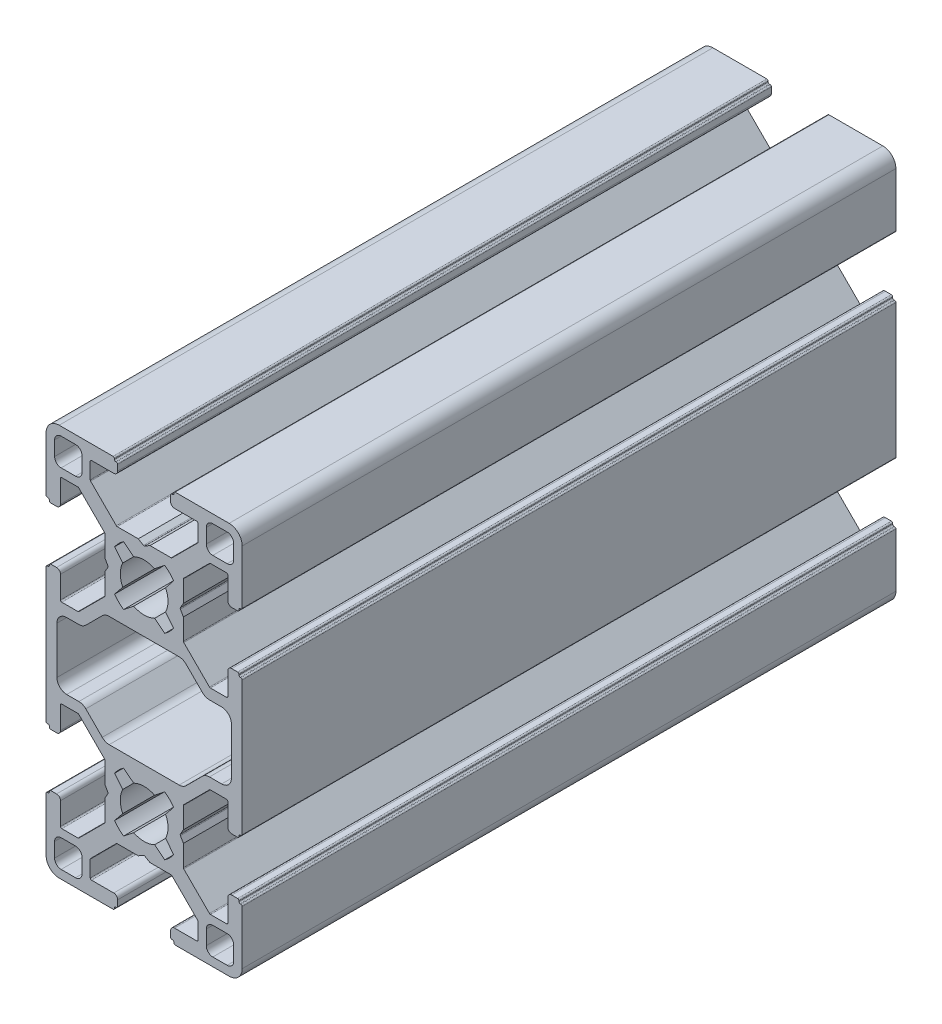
from build123d import *

# Parameters (mm, degrees)
EXTRUDE1_DEPTH = 100


with BuildPart() as part:
    # Sketch1 → Extrude1 (new body)
    with BuildSketch(Plane.XY):
        with BuildLine():
            Line((4.117156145, -21), (0.899999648, -21))
            Line((0.899999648, -21), (0.101934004, -20.53923672))
            ThreePointArc((0.101934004, -20.53923672), (0, -20.511923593), (-0.101934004, -20.53923672))
            Line((-0.101934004, -20.53923672), (-0.899999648, -21))
            Line((-0.899999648, -21), (-4.117156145, -21))
            ThreePointArc((-4.117156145, -21), (-4.193692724, -21.015224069), (-4.258577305, -21.058578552))
            Line((-4.258577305, -21.058578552), (-8.191421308, -24.991421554))
            ThreePointArc((-8.191421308, -24.991421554), (-8.234775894, -25.056306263), (-8.25, -25.132843))
            Line((-8.25, -25.132843), (-8.25, -27.6))
            ThreePointArc((-8.25, -27.6), (-8.191421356, -27.741421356), (-8.05, -27.8))
            Line((-8.05, -27.8), (-4.65, -27.8))
            ThreePointArc((-4.65, -27.8), (-4.225735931, -27.975735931), (-4.05, -28.4))
            Line((-4.05, -28.4), (-4.05, -29.3))
            ThreePointArc((-4.05, -29.3), (-4.108578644, -29.441421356), (-4.25, -29.5))
            Line((-4.25, -29.5), (-4.35, -29.5))
            ThreePointArc((-4.35, -29.5), (-4.491421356, -29.558578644), (-4.55, -29.7))
            Line((-4.55, -29.7), (-4.55, -29.8))
            ThreePointArc((-4.55, -29.8), (-4.608578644, -29.941421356), (-4.75, -30))
            Line((-4.75, -30), (-13, -30))
            ThreePointArc((-13, -30), (-14.414213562, -29.414213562), (-15, -28))
            Line((-15, -28), (-15, -19.750000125))
            ThreePointArc((-15, -19.750000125), (-14.941421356, -19.608578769), (-14.8, -19.550000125))
            Line((-14.8, -19.550000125), (-14.700000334, -19.550000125))
            ThreePointArc((-14.700000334, -19.550000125), (-14.558578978, -19.491421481), (-14.500000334, -19.350000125))
            Line((-14.500000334, -19.350000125), (-14.500000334, -19.25))
            ThreePointArc((-14.500000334, -19.25), (-14.44142169, -19.108578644), (-14.300000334, -19.05))
            Line((-14.300000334, -19.05), (-13.400000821, -19.05))
            ThreePointArc((-13.400000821, -19.05), (-12.975736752, -19.225735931), (-12.800000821, -19.65))
            Line((-12.800000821, -19.65), (-12.800000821, -23.05))
            ThreePointArc((-12.800000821, -23.05), (-12.741422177, -23.191421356), (-12.600000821, -23.25))
            Line((-12.600000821, -23.25), (-10.132842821, -23.25))
            ThreePointArc((-10.132842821, -23.25), (-10.056306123, -23.234775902), (-9.991421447, -23.191421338))
            Line((-9.991421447, -23.191421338), (-6.063045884, -19.263044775))
            ThreePointArc((-6.063045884, -19.263044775), (-6.019691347, -19.198160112), (-6.004467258, -19.121623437))
            Line((-6.004467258, -19.121623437), (-6.004467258, -15.90000009))
            Line((-6.004467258, -15.90000009), (-5.542586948, -15.099999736))
            ThreePointArc((-5.542586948, -15.099999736), (-5.515792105, -15), (-5.542586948, -14.900000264))
            Line((-5.542586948, -14.900000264), (-6.004467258, -14.09999991))
            Line((-6.004467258, -14.09999991), (-6.004467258, -10.878376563))
            ThreePointArc((-6.004467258, -10.878376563), (-6.019691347, -10.801839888), (-6.063045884, -10.736955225))
            Line((-6.063045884, -10.736955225), (-9.991421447, -6.808578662))
            ThreePointArc((-9.991421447, -6.808578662), (-10.056306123, -6.765224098), (-10.132842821, -6.75))
            Line((-10.132842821, -6.75), (-12.600000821, -6.75))
            ThreePointArc((-12.600000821, -6.75), (-12.741422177, -6.808578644), (-12.800000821, -6.95))
            Line((-12.800000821, -6.95), (-12.800000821, -10.35))
            ThreePointArc((-12.800000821, -10.35), (-12.975736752, -10.774264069), (-13.400000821, -10.95))
            Line((-13.400000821, -10.95), (-14.300000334, -10.95))
            ThreePointArc((-14.300000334, -10.95), (-14.44142169, -10.891421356), (-14.500000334, -10.75))
            Line((-14.500000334, -10.75), (-14.500000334, -10.65))
            ThreePointArc((-14.500000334, -10.65), (-14.558578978, -10.508578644), (-14.700000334, -10.45))
            Line((-14.700000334, -10.45), (-14.8, -10.45))
            ThreePointArc((-14.8, -10.45), (-14.941421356, -10.391421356), (-15, -10.25))
            Line((-15, -10.25), (-15, 10.25))
            ThreePointArc((-15, 10.25), (-14.941421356, 10.391421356), (-14.8, 10.45))
            Line((-14.8, 10.45), (-14.700000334, 10.45))
            ThreePointArc((-14.700000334, 10.45), (-14.558578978, 10.508578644), (-14.500000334, 10.65))
            Line((-14.500000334, 10.65), (-14.500000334, 10.75))
            ThreePointArc((-14.500000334, 10.75), (-14.44142169, 10.891421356), (-14.300000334, 10.95))
            Line((-14.300000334, 10.95), (-13.400000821, 10.95))
            ThreePointArc((-13.400000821, 10.95), (-12.975736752, 10.774264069), (-12.800000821, 10.35))
            Line((-12.800000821, 10.35), (-12.800000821, 6.95))
            ThreePointArc((-12.800000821, 6.95), (-12.741422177, 6.808578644), (-12.600000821, 6.75))
            Line((-12.600000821, 6.75), (-10.132842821, 6.75))
            ThreePointArc((-10.132842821, 6.75), (-10.056306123, 6.765224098), (-9.991421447, 6.808578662))
            Line((-9.991421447, 6.808578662), (-6.063045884, 10.736955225))
            ThreePointArc((-6.063045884, 10.736955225), (-6.019691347, 10.801839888), (-6.004467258, 10.878376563))
            Line((-6.004467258, 10.878376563), (-6.004467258, 14.09999991))
            Line((-6.004467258, 14.09999991), (-5.542586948, 14.900000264))
            ThreePointArc((-5.542586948, 14.900000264), (-5.515792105, 15), (-5.542586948, 15.099999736))
            Line((-5.542586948, 15.099999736), (-6.004467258, 15.90000009))
            Line((-6.004467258, 15.90000009), (-6.004467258, 19.121623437))
            ThreePointArc((-6.004467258, 19.121623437), (-6.019691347, 19.198160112), (-6.063045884, 19.263044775))
            Line((-6.063045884, 19.263044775), (-9.991421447, 23.191421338))
            ThreePointArc((-9.991421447, 23.191421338), (-10.056306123, 23.234775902), (-10.132842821, 23.25))
            Line((-10.132842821, 23.25), (-12.600000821, 23.25))
            ThreePointArc((-12.600000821, 23.25), (-12.741422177, 23.191421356), (-12.800000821, 23.05))
            Line((-12.800000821, 23.05), (-12.800000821, 19.65))
            ThreePointArc((-12.800000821, 19.65), (-12.975736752, 19.225735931), (-13.400000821, 19.05))
            Line((-13.400000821, 19.05), (-14.300000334, 19.05))
            ThreePointArc((-14.300000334, 19.05), (-14.44142169, 19.108578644), (-14.500000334, 19.25))
            Line((-14.500000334, 19.25), (-14.500000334, 19.350000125))
            ThreePointArc((-14.500000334, 19.350000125), (-14.558578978, 19.491421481), (-14.700000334, 19.550000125))
            Line((-14.700000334, 19.550000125), (-14.8, 19.550000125))
            ThreePointArc((-14.8, 19.550000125), (-14.941421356, 19.608578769), (-15, 19.750000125))
            Line((-15, 19.750000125), (-15, 28))
            ThreePointArc((-15, 28), (-14.414213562, 29.414213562), (-13, 30))
            Line((-13, 30), (-4.75, 30))
            ThreePointArc((-4.75, 30), (-4.608578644, 29.941421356), (-4.55, 29.8))
            Line((-4.55, 29.8), (-4.55, 29.7))
            ThreePointArc((-4.55, 29.7), (-4.491421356, 29.558578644), (-4.35, 29.5))
            Line((-4.35, 29.5), (-4.25, 29.5))
            ThreePointArc((-4.25, 29.5), (-4.108578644, 29.441421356), (-4.05, 29.3))
            Line((-4.05, 29.3), (-4.05, 28.4))
            ThreePointArc((-4.05, 28.4), (-4.225735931, 27.975735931), (-4.65, 27.8))
            Line((-4.65, 27.8), (-8.05, 27.8))
            ThreePointArc((-8.05, 27.8), (-8.191421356, 27.741421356), (-8.25, 27.6))
            Line((-8.25, 27.6), (-8.25, 25.132843))
            ThreePointArc((-8.25, 25.132843), (-8.234775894, 25.056306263), (-8.191421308, 24.991421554))
            Line((-8.191421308, 24.991421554), (-4.258577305, 21.058578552))
            ThreePointArc((-4.258577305, 21.058578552), (-4.193692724, 21.015224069), (-4.117156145, 21))
            Line((-4.117156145, 21), (-0.899999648, 21))
            Line((-0.899999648, 21), (-0.101934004, 20.53923672))
            ThreePointArc((-0.101934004, 20.53923672), (0, 20.511923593), (0.101934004, 20.53923672))
            Line((0.101934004, 20.53923672), (0.899999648, 21))
            Line((0.899999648, 21), (4.117156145, 21))
            ThreePointArc((4.117156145, 21), (4.193692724, 21.015224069), (4.258577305, 21.058578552))
            Line((4.258577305, 21.058578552), (8.191421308, 24.991421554))
            ThreePointArc((8.191421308, 24.991421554), (8.234775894, 25.056306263), (8.25, 25.132843))
            Line((8.25, 25.132843), (8.25, 27.6))
            ThreePointArc((8.25, 27.6), (8.191421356, 27.741421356), (8.05, 27.8))
            Line((8.05, 27.8), (4.65, 27.8))
            ThreePointArc((4.65, 27.8), (4.225735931, 27.975735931), (4.05, 28.4))
            Line((4.05, 28.4), (4.05, 29.3))
            ThreePointArc((4.05, 29.3), (4.108578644, 29.441421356), (4.25, 29.5))
            Line((4.25, 29.5), (4.35, 29.5))
            ThreePointArc((4.35, 29.5), (4.491421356, 29.558578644), (4.55, 29.7))
            Line((4.55, 29.7), (4.55, 29.8))
            ThreePointArc((4.55, 29.8), (4.608578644, 29.941421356), (4.75, 30))
            Line((4.75, 30), (13, 30))
            ThreePointArc((13, 30), (14.414213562, 29.414213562), (15, 28))
            Line((15, 28), (15, 19.750000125))
            ThreePointArc((15, 19.750000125), (14.941421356, 19.608578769), (14.8, 19.550000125))
            Line((14.8, 19.550000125), (14.700000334, 19.550000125))
            ThreePointArc((14.700000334, 19.550000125), (14.558578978, 19.491421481), (14.500000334, 19.350000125))
            Line((14.500000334, 19.350000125), (14.500000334, 19.25))
            ThreePointArc((14.500000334, 19.25), (14.44142169, 19.108578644), (14.300000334, 19.05))
            Line((14.300000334, 19.05), (13.400000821, 19.05))
            ThreePointArc((13.400000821, 19.05), (12.975736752, 19.225735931), (12.800000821, 19.65))
            Line((12.800000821, 19.65), (12.800000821, 23.05))
            ThreePointArc((12.800000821, 23.05), (12.741422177, 23.191421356), (12.600000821, 23.25))
            Line((12.600000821, 23.25), (10.132842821, 23.25))
            ThreePointArc((10.132842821, 23.25), (10.056306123, 23.234775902), (9.991421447, 23.191421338))
            Line((9.991421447, 23.191421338), (6.063045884, 19.263044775))
            ThreePointArc((6.063045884, 19.263044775), (6.019691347, 19.198160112), (6.004467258, 19.121623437))
            Line((6.004467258, 19.121623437), (6.004467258, 15.90000009))
            Line((6.004467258, 15.90000009), (5.542586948, 15.099999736))
            ThreePointArc((5.542586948, 15.099999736), (5.515792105, 15), (5.542586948, 14.900000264))
            Line((5.542586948, 14.900000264), (6.004467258, 14.09999991))
            Line((6.004467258, 14.09999991), (6.004467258, 10.878376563))
            ThreePointArc((6.004467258, 10.878376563), (6.019691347, 10.801839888), (6.063045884, 10.736955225))
            Line((6.063045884, 10.736955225), (9.991421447, 6.808578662))
            ThreePointArc((9.991421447, 6.808578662), (10.056306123, 6.765224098), (10.132842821, 6.75))
            Line((10.132842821, 6.75), (12.600000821, 6.75))
            ThreePointArc((12.600000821, 6.75), (12.741422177, 6.808578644), (12.800000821, 6.95))
            Line((12.800000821, 6.95), (12.800000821, 10.35))
            ThreePointArc((12.800000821, 10.35), (12.975736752, 10.774264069), (13.400000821, 10.95))
            Line((13.400000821, 10.95), (14.300000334, 10.95))
            ThreePointArc((14.300000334, 10.95), (14.44142169, 10.891421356), (14.500000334, 10.75))
            Line((14.500000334, 10.75), (14.500000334, 10.65))
            ThreePointArc((14.500000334, 10.65), (14.558578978, 10.508578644), (14.700000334, 10.45))
            Line((14.700000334, 10.45), (14.8, 10.45))
            ThreePointArc((14.8, 10.45), (14.941421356, 10.391421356), (15, 10.25))
            Line((15, 10.25), (15, -10.25))
            ThreePointArc((15, -10.25), (14.941421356, -10.391421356), (14.8, -10.45))
            Line((14.8, -10.45), (14.700000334, -10.45))
            ThreePointArc((14.700000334, -10.45), (14.558578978, -10.508578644), (14.500000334, -10.65))
            Line((14.500000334, -10.65), (14.500000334, -10.75))
            ThreePointArc((14.500000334, -10.75), (14.44142169, -10.891421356), (14.300000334, -10.95))
            Line((14.300000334, -10.95), (13.400000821, -10.95))
            ThreePointArc((13.400000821, -10.95), (12.975736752, -10.774264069), (12.800000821, -10.35))
            Line((12.800000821, -10.35), (12.800000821, -6.95))
            ThreePointArc((12.800000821, -6.95), (12.741422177, -6.808578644), (12.600000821, -6.75))
            Line((12.600000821, -6.75), (10.132842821, -6.75))
            ThreePointArc((10.132842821, -6.75), (10.056306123, -6.765224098), (9.991421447, -6.808578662))
            Line((9.991421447, -6.808578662), (6.063045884, -10.736955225))
            ThreePointArc((6.063045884, -10.736955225), (6.019691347, -10.801839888), (6.004467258, -10.878376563))
            Line((6.004467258, -10.878376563), (6.004467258, -14.09999991))
            Line((6.004467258, -14.09999991), (5.542586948, -14.900000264))
            ThreePointArc((5.542586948, -14.900000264), (5.515792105, -15), (5.542586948, -15.099999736))
            Line((5.542586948, -15.099999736), (6.004467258, -15.90000009))
            Line((6.004467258, -15.90000009), (6.004467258, -19.121623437))
            ThreePointArc((6.004467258, -19.121623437), (6.019691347, -19.198160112), (6.063045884, -19.263044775))
            Line((6.063045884, -19.263044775), (9.991421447, -23.191421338))
            ThreePointArc((9.991421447, -23.191421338), (10.056306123, -23.234775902), (10.132842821, -23.25))
            Line((10.132842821, -23.25), (12.600000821, -23.25))
            ThreePointArc((12.600000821, -23.25), (12.741422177, -23.191421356), (12.800000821, -23.05))
            Line((12.800000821, -23.05), (12.800000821, -19.65))
            ThreePointArc((12.800000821, -19.65), (12.975736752, -19.225735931), (13.400000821, -19.05))
            Line((13.400000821, -19.05), (14.300000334, -19.05))
            ThreePointArc((14.300000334, -19.05), (14.44142169, -19.108578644), (14.500000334, -19.25))
            Line((14.500000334, -19.25), (14.500000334, -19.350000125))
            ThreePointArc((14.500000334, -19.350000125), (14.558578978, -19.491421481), (14.700000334, -19.550000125))
            Line((14.700000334, -19.550000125), (14.8, -19.550000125))
            ThreePointArc((14.8, -19.550000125), (14.941421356, -19.608578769), (15, -19.750000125))
            Line((15, -19.750000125), (15, -28))
            ThreePointArc((15, -28), (14.414213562, -29.414213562), (13, -30))
            Line((13, -30), (4.75, -30))
            ThreePointArc((4.75, -30), (4.608578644, -29.941421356), (4.55, -29.8))
            Line((4.55, -29.8), (4.55, -29.7))
            ThreePointArc((4.55, -29.7), (4.491421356, -29.558578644), (4.35, -29.5))
            Line((4.35, -29.5), (4.25, -29.5))
            ThreePointArc((4.25, -29.5), (4.108578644, -29.441421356), (4.05, -29.3))
            Line((4.05, -29.3), (4.05, -28.4))
            ThreePointArc((4.05, -28.4), (4.225735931, -27.975735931), (4.65, -27.8))
            Line((4.65, -27.8), (8.05, -27.8))
            ThreePointArc((8.05, -27.8), (8.191421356, -27.741421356), (8.25, -27.6))
            Line((8.25, -27.6), (8.25, -25.132843))
            ThreePointArc((8.25, -25.132843), (8.234775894, -25.056306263), (8.191421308, -24.991421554))
            Line((8.191421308, -24.991421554), (4.258577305, -21.058578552))
            ThreePointArc((4.258577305, -21.058578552), (4.193692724, -21.015224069), (4.117156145, -21))
        make_face()
        with BuildLine():
            Line((1.600130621, -18.280561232), (3.154670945, -19.505335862))
            ThreePointArc((3.154670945, -19.505335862), (3.897156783, -18.881001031), (4.518401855, -18.135928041))
            Line((4.518401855, -18.135928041), (3.28056155, -16.600129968))
            ThreePointArc((3.28056155, -16.600129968), (3.65, -15), (3.28056155, -13.399870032))
            Line((3.28056155, -13.399870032), (4.518401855, -11.864071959))
            ThreePointArc((4.518401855, -11.864071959), (3.897156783, -11.118998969), (3.154670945, -10.494664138))
            Line((3.154670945, -10.494664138), (1.600130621, -11.719438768))
            ThreePointArc((1.600130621, -11.719438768), (0, -11.35), (-1.600130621, -11.719438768))
            Line((-1.600130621, -11.719438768), (-3.154670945, -10.494664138))
            ThreePointArc((-3.154670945, -10.494664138), (-3.897156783, -11.118998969), (-4.518401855, -11.864071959))
            Line((-4.518401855, -11.864071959), (-3.28056155, -13.399870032))
            ThreePointArc((-3.28056155, -13.399870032), (-3.65, -15), (-3.28056155, -16.600129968))
            Line((-3.28056155, -16.600129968), (-4.518401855, -18.135928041))
            ThreePointArc((-4.518401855, -18.135928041), (-3.897156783, -18.881001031), (-3.154670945, -19.505335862))
            Line((-3.154670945, -19.505335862), (-1.600130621, -18.280561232))
            ThreePointArc((-1.600130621, -18.280561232), (0, -18.65), (1.600130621, -18.280561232))
        make_face(mode=Mode.SUBTRACT)
        with BuildLine():
            Line((10.500000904, -24.500000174), (12.700000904, -24.500000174))
            ThreePointArc((12.700000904, -24.500000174), (13.407107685, -24.792893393), (13.700000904, -25.500000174))
            Line((13.700000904, -25.500000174), (13.700000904, -27.700000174))
            ThreePointArc((13.700000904, -27.700000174), (13.407107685, -28.407106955), (12.700000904, -28.700000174))
            Line((12.700000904, -28.700000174), (10.500000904, -28.700000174))
            ThreePointArc((10.500000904, -28.700000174), (9.792894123, -28.407106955), (9.500000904, -27.700000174))
            Line((9.500000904, -27.700000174), (9.500000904, -25.500000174))
            ThreePointArc((9.500000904, -25.500000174), (9.792894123, -24.792893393), (10.500000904, -24.500000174))
        make_face(mode=Mode.SUBTRACT)
        with BuildLine():
            Line((8.927207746, -5.539339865), (6.410354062, -8.056193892))
            ThreePointArc((6.410354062, -8.056193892), (5.923719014, -8.381353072), (5.349693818, -8.495533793))
            Line((5.349693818, -8.495533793), (-5.349693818, -8.495533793))
            ThreePointArc((-5.349693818, -8.495533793), (-5.923719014, -8.381353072), (-6.410354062, -8.056193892))
            Line((-6.410354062, -8.056193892), (-8.927207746, -5.539339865))
            ThreePointArc((-8.927207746, -5.539339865), (-9.413842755, -5.214180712), (-9.987867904, -5.1))
            Line((-9.987867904, -5.1), (-11.849999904, -5.1))
            ThreePointArc((-11.849999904, -5.1), (-12.910660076, -4.660660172), (-13.349999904, -3.6))
            Line((-13.349999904, -3.6), (-13.349999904, 3.6))
            ThreePointArc((-13.349999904, 3.6), (-12.910660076, 4.660660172), (-11.849999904, 5.1))
            Line((-11.849999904, 5.1), (-9.987867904, 5.1))
            ThreePointArc((-9.987867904, 5.1), (-9.413842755, 5.214180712), (-8.927207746, 5.539339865))
            Line((-8.927207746, 5.539339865), (-6.410354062, 8.056193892))
            ThreePointArc((-6.410354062, 8.056193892), (-5.923719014, 8.381353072), (-5.349693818, 8.495533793))
            Line((-5.349693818, 8.495533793), (5.349693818, 8.495533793))
            ThreePointArc((5.349693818, 8.495533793), (5.923719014, 8.381353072), (6.410354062, 8.056193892))
            Line((6.410354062, 8.056193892), (8.927207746, 5.539339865))
            ThreePointArc((8.927207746, 5.539339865), (9.413842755, 5.214180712), (9.987867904, 5.1))
            Line((9.987867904, 5.1), (11.849999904, 5.1))
            ThreePointArc((11.849999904, 5.1), (12.910660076, 4.660660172), (13.349999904, 3.6))
            Line((13.349999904, 3.6), (13.349999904, -3.6))
            ThreePointArc((13.349999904, -3.6), (12.910660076, -4.660660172), (11.849999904, -5.1))
            Line((11.849999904, -5.1), (9.987867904, -5.1))
            ThreePointArc((9.987867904, -5.1), (9.413842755, -5.214180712), (8.927207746, -5.539339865))
        make_face(mode=Mode.SUBTRACT)
        with BuildLine():
            Line((-1.600130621, 18.280561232), (-3.154670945, 19.505335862))
            ThreePointArc((-3.154670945, 19.505335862), (-3.897156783, 18.881001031), (-4.518401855, 18.135928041))
            Line((-4.518401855, 18.135928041), (-3.28056155, 16.600129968))
            ThreePointArc((-3.28056155, 16.600129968), (-3.65, 15), (-3.28056155, 13.399870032))
            Line((-3.28056155, 13.399870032), (-4.518401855, 11.864071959))
            ThreePointArc((-4.518401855, 11.864071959), (-3.897156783, 11.118998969), (-3.154670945, 10.494664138))
            Line((-3.154670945, 10.494664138), (-1.600130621, 11.719438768))
            ThreePointArc((-1.600130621, 11.719438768), (0, 11.35), (1.600130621, 11.719438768))
            Line((1.600130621, 11.719438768), (3.154670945, 10.494664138))
            ThreePointArc((3.154670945, 10.494664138), (3.897156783, 11.118998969), (4.518401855, 11.864071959))
            Line((4.518401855, 11.864071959), (3.28056155, 13.399870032))
            ThreePointArc((3.28056155, 13.399870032), (3.65, 15), (3.28056155, 16.600129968))
            Line((3.28056155, 16.600129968), (4.518401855, 18.135928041))
            ThreePointArc((4.518401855, 18.135928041), (3.897156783, 18.881001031), (3.154670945, 19.505335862))
            Line((3.154670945, 19.505335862), (1.600130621, 18.280561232))
            ThreePointArc((1.600130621, 18.280561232), (0, 18.65), (-1.600130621, 18.280561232))
        make_face(mode=Mode.SUBTRACT)
        with BuildLine():
            Line((-10.500000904, 24.500000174), (-12.700000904, 24.500000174))
            ThreePointArc((-12.700000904, 24.500000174), (-13.407107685, 24.792893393), (-13.700000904, 25.500000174))
            Line((-13.700000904, 25.500000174), (-13.700000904, 27.700000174))
            ThreePointArc((-13.700000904, 27.700000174), (-13.407107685, 28.407106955), (-12.700000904, 28.700000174))
            Line((-12.700000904, 28.700000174), (-10.500000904, 28.700000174))
            ThreePointArc((-10.500000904, 28.700000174), (-9.792894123, 28.407106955), (-9.500000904, 27.700000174))
            Line((-9.500000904, 27.700000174), (-9.500000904, 25.500000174))
            ThreePointArc((-9.500000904, 25.500000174), (-9.792894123, 24.792893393), (-10.500000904, 24.500000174))
        make_face(mode=Mode.SUBTRACT)
        with BuildLine():
            Line((9.500000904, 27.700000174), (9.500000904, 25.500000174))
            ThreePointArc((9.500000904, 25.500000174), (9.792894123, 24.792893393), (10.500000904, 24.500000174))
            Line((10.500000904, 24.500000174), (12.700000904, 24.500000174))
            ThreePointArc((12.700000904, 24.500000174), (13.407107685, 24.792893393), (13.700000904, 25.500000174))
            Line((13.700000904, 25.500000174), (13.700000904, 27.700000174))
            ThreePointArc((13.700000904, 27.700000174), (13.407107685, 28.407106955), (12.700000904, 28.700000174))
            Line((12.700000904, 28.700000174), (10.500000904, 28.700000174))
            ThreePointArc((10.500000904, 28.700000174), (9.792894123, 28.407106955), (9.500000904, 27.700000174))
        make_face(mode=Mode.SUBTRACT)
        with BuildLine():
            Line((-9.500000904, -27.700000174), (-9.500000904, -25.500000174))
            ThreePointArc((-9.500000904, -25.500000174), (-9.792894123, -24.792893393), (-10.500000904, -24.500000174))
            Line((-10.500000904, -24.500000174), (-12.700000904, -24.500000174))
            ThreePointArc((-12.700000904, -24.500000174), (-13.407107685, -24.792893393), (-13.700000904, -25.500000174))
            Line((-13.700000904, -25.500000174), (-13.700000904, -27.700000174))
            ThreePointArc((-13.700000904, -27.700000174), (-13.407107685, -28.407106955), (-12.700000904, -28.700000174))
            Line((-12.700000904, -28.700000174), (-10.500000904, -28.700000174))
            ThreePointArc((-10.500000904, -28.700000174), (-9.792894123, -28.407106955), (-9.500000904, -27.700000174))
        make_face(mode=Mode.SUBTRACT)
    extrude(amount=EXTRUDE1_DEPTH)


solid = part.part
